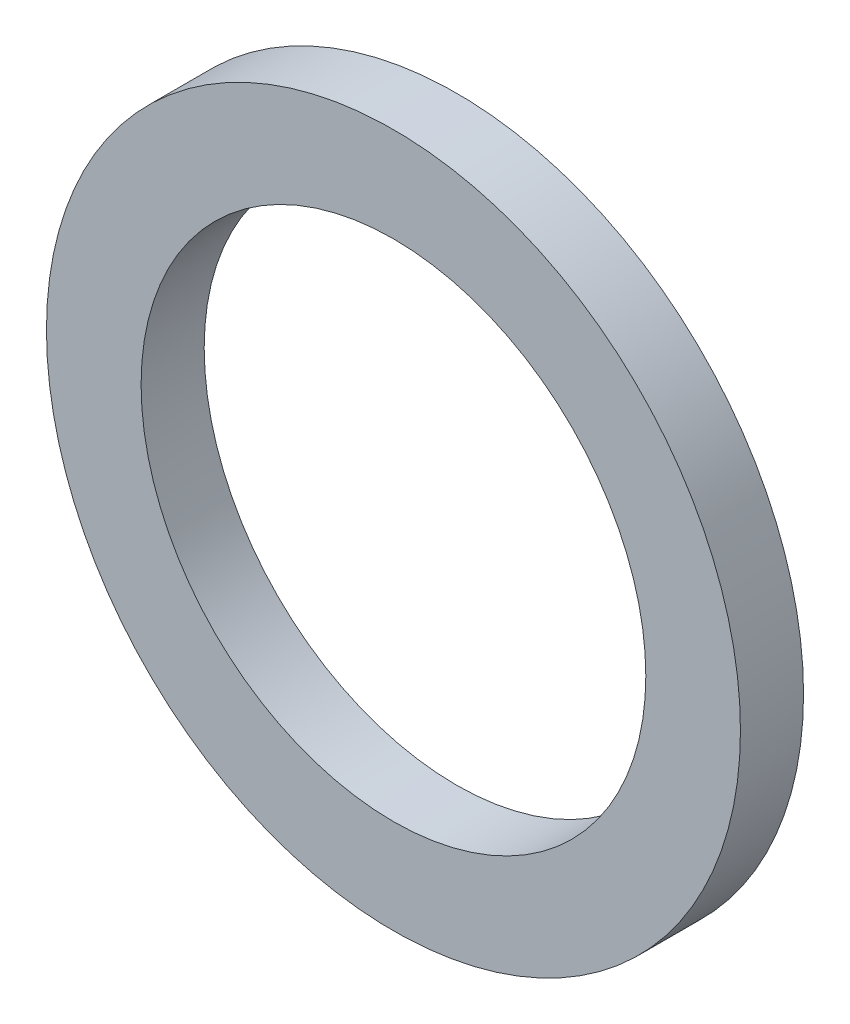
ISO-10303-21;
HEADER;
FILE_DESCRIPTION(('STEP AP214'),'2;1');
FILE_NAME('part.step','',(''),(''),'','','');
FILE_SCHEMA(('AUTOMOTIVE_DESIGN { 1 0 10303 214 1 1 1 1 }'));
ENDSEC;
DATA;
#1=APPLICATION_CONTEXT('core data for automotive mechanical design processes');
#2=APPLICATION_PROTOCOL_DEFINITION('international standard','automotive_design',2000,#1);
#3=PRODUCT_CONTEXT('',#1,'mechanical');
#4=PRODUCT('Part','Part','',(#3));
#5=PRODUCT_RELATED_PRODUCT_CATEGORY('part','',(#4));
#6=PRODUCT_DEFINITION_FORMATION('','',#4);
#7=PRODUCT_DEFINITION_CONTEXT('part definition',#1,'design');
#8=PRODUCT_DEFINITION('design','',#6,#7);
#9=PRODUCT_DEFINITION_SHAPE('','',#8);
#10=(LENGTH_UNIT() NAMED_UNIT(*) SI_UNIT(.MILLI.,.METRE.));
#11=(NAMED_UNIT(*) PLANE_ANGLE_UNIT() SI_UNIT($,.RADIAN.));
#12=(NAMED_UNIT(*) SI_UNIT($,.STERADIAN.) SOLID_ANGLE_UNIT());
#13=UNCERTAINTY_MEASURE_WITH_UNIT(LENGTH_MEASURE(1.E-05),#10,'distance_accuracy_value','');
#14=(GEOMETRIC_REPRESENTATION_CONTEXT(3) GLOBAL_UNCERTAINTY_ASSIGNED_CONTEXT((#13)) GLOBAL_UNIT_ASSIGNED_CONTEXT((#10,
#11,#12)) REPRESENTATION_CONTEXT('',''));
#15=CARTESIAN_POINT('',(0.,0.,0.));
#16=DIRECTION('',(0.,0.,1.));
#17=DIRECTION('',(1.,0.,0.));
#18=AXIS2_PLACEMENT_3D('',#15,#16,#17);
#19=CARTESIAN_POINT('',(0.,0.,5.));
#20=DIRECTION('',(0.,0.,0.999999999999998));
#21=DIRECTION('',(1.,0.,0.));
#22=AXIS2_PLACEMENT_3D('',#19,#20,#21);
#23=PLANE('',#22);
#24=CARTESIAN_POINT('',(0.,0.,5.));
#25=DIRECTION('',(0.,0.,0.999999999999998));
#26=DIRECTION('',(1.,0.,0.));
#27=AXIS2_PLACEMENT_3D('',#24,#25,#26);
#28=CIRCLE('',#27,27.5);
#29=CARTESIAN_POINT('',(-27.5000000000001,0.,5.));
#30=VERTEX_POINT('',#29);
#31=EDGE_CURVE('E10',#30,#30,#28,.T.);
#32=ORIENTED_EDGE('',*,*,#31,.T.);
#33=EDGE_LOOP('',(#32));
#34=FACE_BOUND('',#33,.T.);
#35=CARTESIAN_POINT('',(0.,0.,5.));
#36=DIRECTION('',(0.,0.,0.999999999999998));
#37=DIRECTION('',(1.,0.,0.));
#38=AXIS2_PLACEMENT_3D('',#35,#36,#37);
#39=CIRCLE('',#38,20.);
#40=CARTESIAN_POINT('',(-20.0000000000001,0.,5.));
#41=VERTEX_POINT('',#40);
#42=EDGE_CURVE('E359',#41,#41,#39,.T.);
#43=ORIENTED_EDGE('',*,*,#42,.F.);
#44=EDGE_LOOP('',(#43));
#45=FACE_BOUND('',#44,.T.);
#46=ADVANCED_FACE('F348',(#34,#45),#23,.T.);
#47=CARTESIAN_POINT('',(0.,0.,0.));
#48=DIRECTION('',(0.,0.,0.999999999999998));
#49=DIRECTION('',(1.,0.,0.));
#50=AXIS2_PLACEMENT_3D('',#47,#48,#49);
#51=PLANE('',#50);
#52=CARTESIAN_POINT('',(0.,0.,0.));
#53=DIRECTION('',(0.,0.,0.999999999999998));
#54=DIRECTION('',(1.,0.,0.));
#55=AXIS2_PLACEMENT_3D('',#52,#53,#54);
#56=CIRCLE('',#55,27.5);
#57=CARTESIAN_POINT('',(-27.5000000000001,0.,0.));
#58=VERTEX_POINT('',#57);
#59=EDGE_CURVE('E355',#58,#58,#56,.T.);
#60=ORIENTED_EDGE('',*,*,#59,.F.);
#61=EDGE_LOOP('',(#60));
#62=FACE_BOUND('',#61,.T.);
#63=CARTESIAN_POINT('',(0.,0.,0.));
#64=DIRECTION('',(0.,0.,0.999999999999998));
#65=DIRECTION('',(1.,0.,0.));
#66=AXIS2_PLACEMENT_3D('',#63,#64,#65);
#67=CIRCLE('',#66,20.);
#68=CARTESIAN_POINT('',(-20.0000000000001,0.,0.));
#69=VERTEX_POINT('',#68);
#70=EDGE_CURVE('E363',#69,#69,#67,.T.);
#71=ORIENTED_EDGE('',*,*,#70,.T.);
#72=EDGE_LOOP('',(#71));
#73=FACE_BOUND('',#72,.T.);
#74=ADVANCED_FACE('F369',(#62,#73),#51,.F.);
#75=CARTESIAN_POINT('',(0.,0.,5.));
#76=DIRECTION('',(0.,0.,-0.999999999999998));
#77=DIRECTION('',(-1.,0.,0.));
#78=AXIS2_PLACEMENT_3D('',#75,#76,#77);
#79=CYLINDRICAL_SURFACE('',#78,27.5);
#80=CARTESIAN_POINT('',(-27.5000000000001,0.,5.));
#81=CARTESIAN_POINT('',(-27.5000000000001,0.,4.94791666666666));
#82=CARTESIAN_POINT('',(-27.5000000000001,0.,4.89583333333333));
#83=CARTESIAN_POINT('',(-27.5000000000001,0.,4.79166666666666));
#84=CARTESIAN_POINT('',(-27.5000000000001,0.,4.73958333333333));
#85=CARTESIAN_POINT('',(-27.5000000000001,0.,4.63541666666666));
#86=CARTESIAN_POINT('',(-27.5000000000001,0.,4.58333333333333));
#87=CARTESIAN_POINT('',(-27.5000000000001,0.,4.47916666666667));
#88=CARTESIAN_POINT('',(-27.5000000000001,0.,4.42708333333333));
#89=CARTESIAN_POINT('',(-27.5000000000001,0.,4.32291666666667));
#90=CARTESIAN_POINT('',(-27.5000000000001,0.,4.27083333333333));
#91=CARTESIAN_POINT('',(-27.5000000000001,0.,4.16666666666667));
#92=CARTESIAN_POINT('',(-27.5000000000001,0.,4.11458333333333));
#93=CARTESIAN_POINT('',(-27.5000000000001,0.,4.01041666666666));
#94=CARTESIAN_POINT('',(-27.5000000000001,0.,3.95833333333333));
#95=CARTESIAN_POINT('',(-27.5000000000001,0.,3.85416666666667));
#96=CARTESIAN_POINT('',(-27.5000000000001,0.,3.80208333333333));
#97=CARTESIAN_POINT('',(-27.5000000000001,0.,3.69791666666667));
#98=CARTESIAN_POINT('',(-27.5000000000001,0.,3.64583333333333));
#99=CARTESIAN_POINT('',(-27.5000000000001,0.,3.54166666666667));
#100=CARTESIAN_POINT('',(-27.5000000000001,0.,3.48958333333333));
#101=CARTESIAN_POINT('',(-27.5000000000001,0.,3.38541666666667));
#102=CARTESIAN_POINT('',(-27.5000000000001,0.,3.33333333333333));
#103=CARTESIAN_POINT('',(-27.5000000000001,0.,3.22916666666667));
#104=CARTESIAN_POINT('',(-27.5000000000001,0.,3.17708333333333));
#105=CARTESIAN_POINT('',(-27.5000000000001,0.,3.07291666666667));
#106=CARTESIAN_POINT('',(-27.5000000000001,0.,3.02083333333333));
#107=CARTESIAN_POINT('',(-27.5000000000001,0.,2.91666666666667));
#108=CARTESIAN_POINT('',(-27.5000000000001,0.,2.86458333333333));
#109=CARTESIAN_POINT('',(-27.5000000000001,0.,2.76041666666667));
#110=CARTESIAN_POINT('',(-27.5000000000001,0.,2.70833333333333));
#111=CARTESIAN_POINT('',(-27.5000000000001,0.,2.60416666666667));
#112=CARTESIAN_POINT('',(-27.5000000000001,0.,2.55208333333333));
#113=CARTESIAN_POINT('',(-27.5000000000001,0.,2.44791666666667));
#114=CARTESIAN_POINT('',(-27.5000000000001,0.,2.39583333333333));
#115=CARTESIAN_POINT('',(-27.5000000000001,0.,2.29166666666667));
#116=CARTESIAN_POINT('',(-27.5000000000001,0.,2.23958333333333));
#117=CARTESIAN_POINT('',(-27.5000000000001,0.,2.13541666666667));
#118=CARTESIAN_POINT('',(-27.5000000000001,0.,2.08333333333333));
#119=CARTESIAN_POINT('',(-27.5000000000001,0.,1.97916666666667));
#120=CARTESIAN_POINT('',(-27.5000000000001,0.,1.92708333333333));
#121=CARTESIAN_POINT('',(-27.5000000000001,0.,1.82291666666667));
#122=CARTESIAN_POINT('',(-27.5000000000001,0.,1.77083333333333));
#123=CARTESIAN_POINT('',(-27.5000000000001,0.,1.66666666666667));
#124=CARTESIAN_POINT('',(-27.5000000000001,0.,1.61458333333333));
#125=CARTESIAN_POINT('',(-27.5000000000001,0.,1.51041666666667));
#126=CARTESIAN_POINT('',(-27.5000000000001,0.,1.45833333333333));
#127=CARTESIAN_POINT('',(-27.5000000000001,0.,1.35416666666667));
#128=CARTESIAN_POINT('',(-27.5000000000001,0.,1.30208333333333));
#129=CARTESIAN_POINT('',(-27.5000000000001,0.,1.19791666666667));
#130=CARTESIAN_POINT('',(-27.5000000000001,0.,1.14583333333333));
#131=CARTESIAN_POINT('',(-27.5000000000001,0.,1.04166666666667));
#132=CARTESIAN_POINT('',(-27.5000000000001,0.,0.989583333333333));
#133=CARTESIAN_POINT('',(-27.5000000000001,0.,0.885416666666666));
#134=CARTESIAN_POINT('',(-27.5000000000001,0.,0.833333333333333));
#135=CARTESIAN_POINT('',(-27.5000000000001,0.,0.729166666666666));
#136=CARTESIAN_POINT('',(-27.5000000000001,0.,0.677083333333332));
#137=CARTESIAN_POINT('',(-27.5000000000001,0.,0.572916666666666));
#138=CARTESIAN_POINT('',(-27.5000000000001,0.,0.520833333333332));
#139=CARTESIAN_POINT('',(-27.5000000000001,0.,0.416666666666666));
#140=CARTESIAN_POINT('',(-27.5000000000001,0.,0.364583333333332));
#141=CARTESIAN_POINT('',(-27.5000000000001,0.,0.260416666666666));
#142=CARTESIAN_POINT('',(-27.5000000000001,0.,0.208333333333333));
#143=CARTESIAN_POINT('',(-27.5000000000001,0.,0.104166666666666));
#144=CARTESIAN_POINT('',(-27.5000000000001,0.,0.0520833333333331));
#145=CARTESIAN_POINT('',(-27.5000000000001,0.,0.));
#146=B_SPLINE_CURVE_WITH_KNOTS('',3,(#80,#81,#82,#83,#84,#85,#86,#87,#88,#89,#90,#91,#92,#93,
#94,#95,#96,#97,#98,#99,#100,#101,#102,#103,#104,#105,#106,#107,#108,#109,#110,#111,#112,#113,
#114,#115,#116,#117,#118,#119,#120,#121,#122,#123,#124,#125,#126,#127,#128,#129,#130,#131,#132,
#133,#134,#135,#136,#137,#138,#139,#140,#141,#142,#143,#144,#145),.UNSPECIFIED.,.F.,.F.,(4,2,2,
2,2,2,2,2,2,2,2,2,2,2,2,2,2,2,2,2,2,2,2,2,2,2,2,2,2,2,2,2,4),(0.,0.156249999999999,
0.312499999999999,0.46875,0.624999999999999,0.781249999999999,0.937499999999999,1.09375,1.25,
1.40625,1.5625,1.71875,1.875,2.03125,2.1875,2.34375,2.5,2.65625,2.8125,2.96875,3.125,3.28125,
3.4375,3.59375,3.75,3.90625,4.0625,4.21875,4.375,4.53125,4.6875,4.84375,5.),.UNSPECIFIED.);
#147=EDGE_CURVE('BSEAM350',#30,#58,#146,.T.);
#148=ORIENTED_EDGE('',*,*,#31,.F.);
#149=ORIENTED_EDGE('',*,*,#59,.T.);
#150=ORIENTED_EDGE('',*,*,#147,.T.);
#151=ORIENTED_EDGE('',*,*,#147,.F.);
#152=EDGE_LOOP('',(#148,#150,#149,#151));
#153=FACE_BOUND('',#152,.T.);
#154=ADVANCED_FACE('F350',(#153),#79,.T.);
#155=CARTESIAN_POINT('',(0.,0.,5.));
#156=DIRECTION('',(0.,0.,-0.999999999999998));
#157=DIRECTION('',(-1.,0.,0.));
#158=AXIS2_PLACEMENT_3D('',#155,#156,#157);
#159=CYLINDRICAL_SURFACE('',#158,20.);
#160=CARTESIAN_POINT('',(-20.0000000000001,0.,5.));
#161=CARTESIAN_POINT('',(-20.0000000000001,0.,4.94791666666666));
#162=CARTESIAN_POINT('',(-20.0000000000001,0.,4.89583333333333));
#163=CARTESIAN_POINT('',(-20.0000000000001,0.,4.79166666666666));
#164=CARTESIAN_POINT('',(-20.0000000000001,0.,4.73958333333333));
#165=CARTESIAN_POINT('',(-20.0000000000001,0.,4.63541666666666));
#166=CARTESIAN_POINT('',(-20.0000000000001,0.,4.58333333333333));
#167=CARTESIAN_POINT('',(-20.0000000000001,0.,4.47916666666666));
#168=CARTESIAN_POINT('',(-20.0000000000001,0.,4.42708333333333));
#169=CARTESIAN_POINT('',(-20.0000000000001,0.,4.32291666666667));
#170=CARTESIAN_POINT('',(-20.0000000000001,0.,4.27083333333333));
#171=CARTESIAN_POINT('',(-20.0000000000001,0.,4.16666666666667));
#172=CARTESIAN_POINT('',(-20.0000000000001,0.,4.11458333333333));
#173=CARTESIAN_POINT('',(-20.0000000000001,0.,4.01041666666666));
#174=CARTESIAN_POINT('',(-20.0000000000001,0.,3.95833333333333));
#175=CARTESIAN_POINT('',(-20.0000000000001,0.,3.85416666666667));
#176=CARTESIAN_POINT('',(-20.0000000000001,0.,3.80208333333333));
#177=CARTESIAN_POINT('',(-20.0000000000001,0.,3.69791666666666));
#178=CARTESIAN_POINT('',(-20.0000000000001,0.,3.64583333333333));
#179=CARTESIAN_POINT('',(-20.0000000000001,0.,3.54166666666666));
#180=CARTESIAN_POINT('',(-20.0000000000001,0.,3.48958333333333));
#181=CARTESIAN_POINT('',(-20.0000000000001,0.,3.38541666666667));
#182=CARTESIAN_POINT('',(-20.0000000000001,0.,3.33333333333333));
#183=CARTESIAN_POINT('',(-20.0000000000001,0.,3.22916666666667));
#184=CARTESIAN_POINT('',(-20.0000000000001,0.,3.17708333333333));
#185=CARTESIAN_POINT('',(-20.0000000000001,0.,3.07291666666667));
#186=CARTESIAN_POINT('',(-20.0000000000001,0.,3.02083333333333));
#187=CARTESIAN_POINT('',(-20.0000000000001,0.,2.91666666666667));
#188=CARTESIAN_POINT('',(-20.0000000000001,0.,2.86458333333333));
#189=CARTESIAN_POINT('',(-20.0000000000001,0.,2.76041666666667));
#190=CARTESIAN_POINT('',(-20.0000000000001,0.,2.70833333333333));
#191=CARTESIAN_POINT('',(-20.0000000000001,0.,2.60416666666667));
#192=CARTESIAN_POINT('',(-20.0000000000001,0.,2.55208333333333));
#193=CARTESIAN_POINT('',(-20.0000000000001,0.,2.44791666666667));
#194=CARTESIAN_POINT('',(-20.0000000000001,0.,2.39583333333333));
#195=CARTESIAN_POINT('',(-20.0000000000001,0.,2.29166666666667));
#196=CARTESIAN_POINT('',(-20.0000000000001,0.,2.23958333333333));
#197=CARTESIAN_POINT('',(-20.0000000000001,0.,2.13541666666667));
#198=CARTESIAN_POINT('',(-20.0000000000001,0.,2.08333333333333));
#199=CARTESIAN_POINT('',(-20.0000000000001,0.,1.97916666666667));
#200=CARTESIAN_POINT('',(-20.0000000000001,0.,1.92708333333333));
#201=CARTESIAN_POINT('',(-20.0000000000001,0.,1.82291666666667));
#202=CARTESIAN_POINT('',(-20.0000000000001,0.,1.77083333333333));
#203=CARTESIAN_POINT('',(-20.0000000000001,0.,1.66666666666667));
#204=CARTESIAN_POINT('',(-20.0000000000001,0.,1.61458333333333));
#205=CARTESIAN_POINT('',(-20.0000000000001,0.,1.51041666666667));
#206=CARTESIAN_POINT('',(-20.0000000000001,0.,1.45833333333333));
#207=CARTESIAN_POINT('',(-20.0000000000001,0.,1.35416666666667));
#208=CARTESIAN_POINT('',(-20.0000000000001,0.,1.30208333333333));
#209=CARTESIAN_POINT('',(-20.0000000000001,0.,1.19791666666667));
#210=CARTESIAN_POINT('',(-20.0000000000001,0.,1.14583333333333));
#211=CARTESIAN_POINT('',(-20.0000000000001,0.,1.04166666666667));
#212=CARTESIAN_POINT('',(-20.0000000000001,0.,0.989583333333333));
#213=CARTESIAN_POINT('',(-20.0000000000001,0.,0.885416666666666));
#214=CARTESIAN_POINT('',(-20.0000000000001,0.,0.833333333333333));
#215=CARTESIAN_POINT('',(-20.0000000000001,0.,0.729166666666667));
#216=CARTESIAN_POINT('',(-20.0000000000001,0.,0.677083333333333));
#217=CARTESIAN_POINT('',(-20.0000000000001,0.,0.572916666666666));
#218=CARTESIAN_POINT('',(-20.0000000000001,0.,0.520833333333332));
#219=CARTESIAN_POINT('',(-20.0000000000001,0.,0.416666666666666));
#220=CARTESIAN_POINT('',(-20.0000000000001,0.,0.364583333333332));
#221=CARTESIAN_POINT('',(-20.0000000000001,0.,0.260416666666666));
#222=CARTESIAN_POINT('',(-20.0000000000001,0.,0.208333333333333));
#223=CARTESIAN_POINT('',(-20.0000000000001,0.,0.104166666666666));
#224=CARTESIAN_POINT('',(-20.0000000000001,0.,0.0520833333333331));
#225=CARTESIAN_POINT('',(-20.0000000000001,0.,0.));
#226=B_SPLINE_CURVE_WITH_KNOTS('',3,(#160,#161,#162,#163,#164,#165,#166,#167,#168,#169,#170,
#171,#172,#173,#174,#175,#176,#177,#178,#179,#180,#181,#182,#183,#184,#185,#186,#187,#188,#189,
#190,#191,#192,#193,#194,#195,#196,#197,#198,#199,#200,#201,#202,#203,#204,#205,#206,#207,#208,
#209,#210,#211,#212,#213,#214,#215,#216,#217,#218,#219,#220,#221,#222,#223,#224,#225),
.UNSPECIFIED.,.F.,.F.,(4,2,2,2,2,2,2,2,2,2,2,2,2,2,2,2,2,2,2,2,2,2,2,2,2,2,2,2,2,2,2,2,4),(0.,
0.15625,0.3125,0.46875,0.625000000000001,0.78125,0.9375,1.09375,1.25,1.40625,1.5625,1.71875,
1.875,2.03125,2.1875,2.34375,2.5,2.65625,2.8125,2.96875,3.125,3.28125,3.4375,3.59375,3.75,
3.90625,4.0625,4.21875,4.375,4.53125,4.6875,4.84375,5.),.UNSPECIFIED.);
#227=EDGE_CURVE('BSEAM371',#41,#69,#226,.T.);
#228=ORIENTED_EDGE('',*,*,#42,.T.);
#229=ORIENTED_EDGE('',*,*,#70,.F.);
#230=ORIENTED_EDGE('',*,*,#227,.T.);
#231=ORIENTED_EDGE('',*,*,#227,.F.);
#232=EDGE_LOOP('',(#228,#230,#229,#231));
#233=FACE_BOUND('',#232,.T.);
#234=ADVANCED_FACE('F371',(#233),#159,.F.);
#235=CLOSED_SHELL('',(#46,#74,#154,#234));
#236=MANIFOLD_SOLID_BREP('B2',#235);
#237=ADVANCED_BREP_SHAPE_REPRESENTATION('',(#18,#236),#14);
#238=SHAPE_DEFINITION_REPRESENTATION(#9,#237);
ENDSEC;
END-ISO-10303-21;
